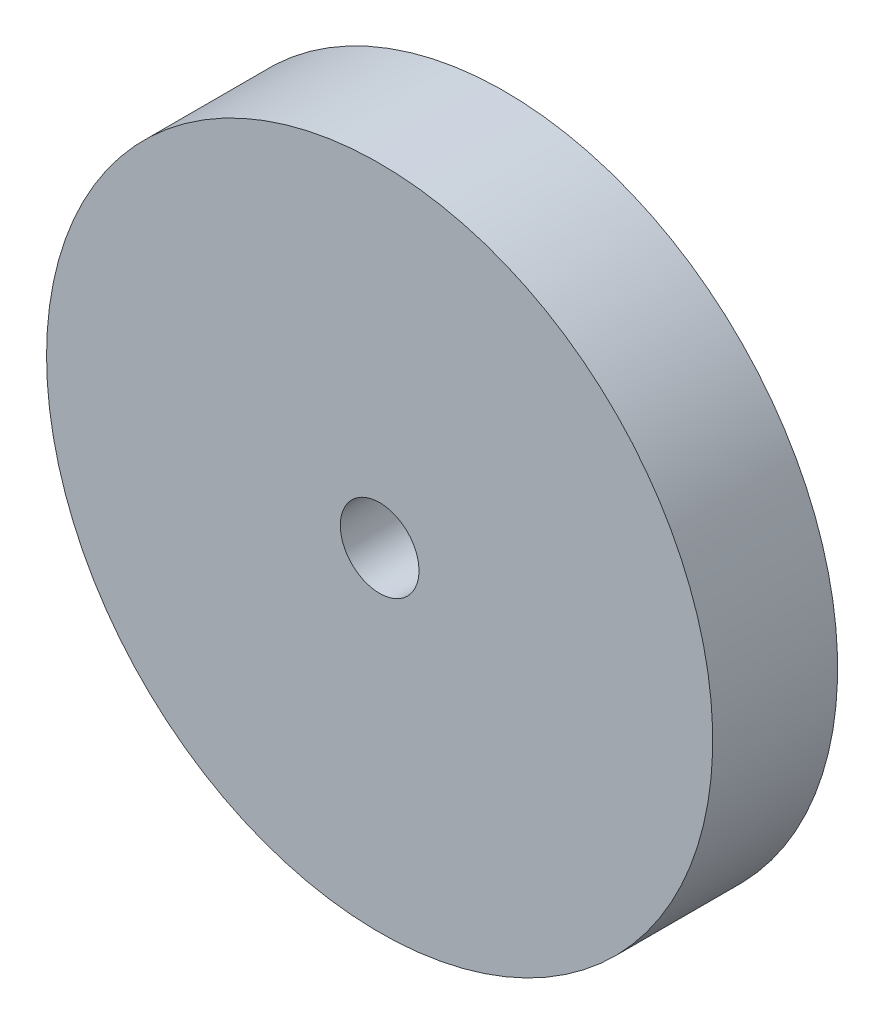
from build123d import *

# Parameters (mm, degrees)
SKETCH1_R           = 25.4
SKETCH1_R_2         = 3
BOSS_EXTRUDE1_DEPTH = 9.525


with BuildPart() as part:
    # Sketch1 → Boss-Extrude1 (new body)
    with BuildSketch(Plane.XY):
        with Locations(Location((0, 0, 0), (0, 0, 180))):
            Circle(SKETCH1_R)
        with Locations(Location((0, 0, 0), (0, 0, 180))):
            Circle(SKETCH1_R_2, mode=Mode.SUBTRACT)
    extrude(amount=BOSS_EXTRUDE1_DEPTH)


solid = part.part
